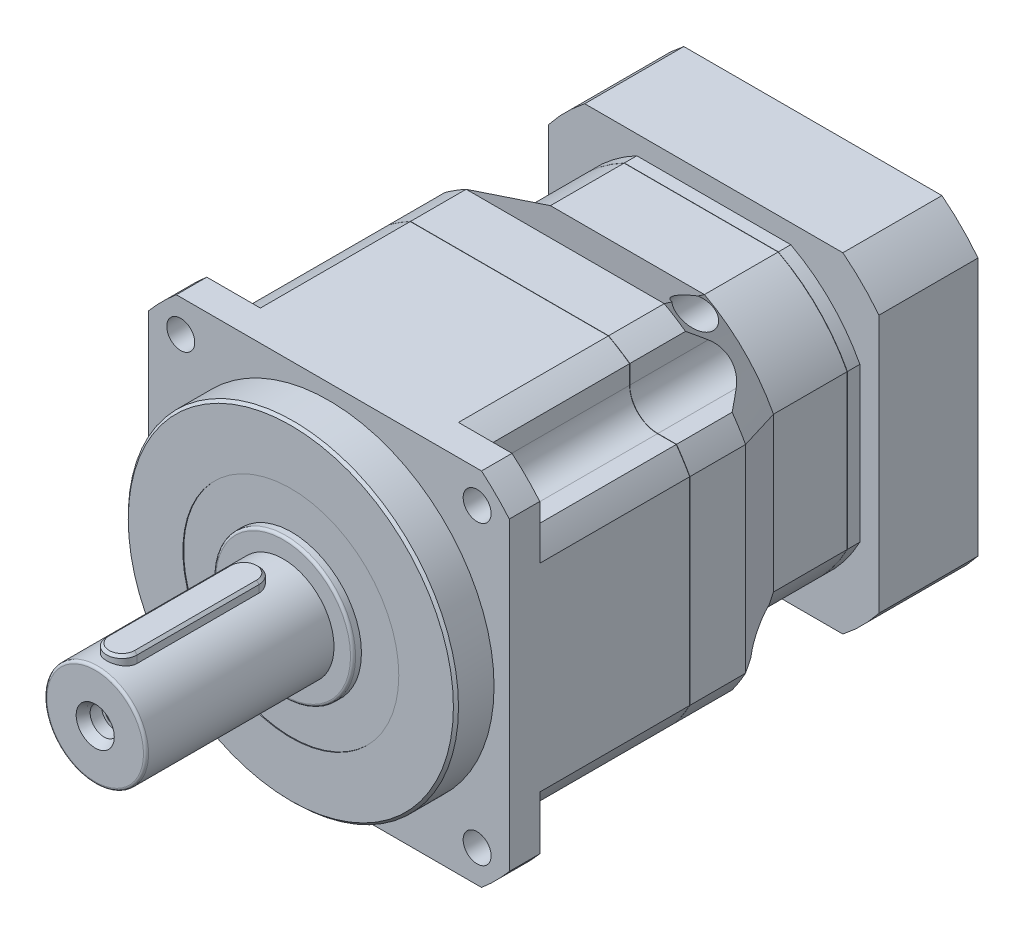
from build123d import *

# Parameters (mm, degrees)
EXTRUDE_1_DEPTH           = 12
SKETCH_2_R                = 65
EXTRUDE_2_DEPTH           = 15
EXTRUDE_3_DEPTH           = 59
SKETCH_4_W                = 30.965241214
SKETCH_4_H                = 26.742708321
CUT_EXTRUDE_1_DEPTH       = 59
PATTERN_CIRCULAR_1_COUNT  = 4
FILLET_1_R                = 11
EXTRUDE_4_DEPTH           = 21.9
EXTRUDE_12_DEPTH          = 29
CUT_EXTRUDE_2_DEPTH       = 50
PATTERN_CIRCULAR_2_COUNT  = 4
EXTRUDE_5_DEPTH           = 4.9
SKETCH_8_W                = 130
SKETCH_8_H                = 130
EXTRUDE_6_DEPTH           = 39
SKETCH_9_OUTSIDE_W        = 201.466
SKETCH_9_OUTSIDE_H        = 201.466
SKETCH_9_OUTSIDE_R        = 82.5
CUT_EXTRUDE_3_DEPTH       = 39
SKETCH_10_R               = 55
CUT_EXTRUDE_4_DEPTH       = 11
SKETCH_26_R               = 54.5
CUT_EXTRUDE_12_DEPTH      = 8.5
SKETCH_27_R               = 7
CUT_EXTRUDE_13_DEPTH      = 32.5
PATTERN_CIRCULAR_7_COUNT  = 6
SKETCH_28_R               = 37
CUT_EXTRUDE_14_DEPTH      = 21
SKETCH_29_R               = 32
EXTRUDE_13_DEPTH          = 20.5
CHAMFER_4_SIZE            = 1.5
SKETCH_30_R               = 12
CUT_EXTRUDE_15_DEPTH      = 65.5
SKETCH_31_W               = 68.763053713
SKETCH_31_H               = 1
CUT_EXTRUDE_16_DEPTH      = 20.5
SKETCH_32_R               = 6
EXTRUDE_14_DEPTH          = 7
PATTERN_CIRCULAR_8_COUNT  = 6
PATTERN_CIRCULAR_9_COUNT  = 4
CHAMFER_2_SIZE            = 1
SKETCH_19_R               = 5.5
CUT_EXTRUDE_10_DEPTH      = 83.5
PATTERN_CIRCULAR_5_COUNT  = 4
SKETCH_20_R               = 27.5
EXTRUDE_8_DEPTH           = 3
FILLET_3_R                = 1
SKETCH_21_R               = 20
EXTRUDE_9_DEPTH           = 74
FILLET_4_R                = 1
CUT_EXTRUDE_START         = -0.3
SKETCH_22_R               = 42.5
SKETCH_22_R_2             = 27.5
CUT_EXTRUDE_11_DEPTH      = 0.3
EXTRUDE_10_DEPTH          = 23
CHAMFER_3_SIZE            = 1
SKETCH_35_R               = 7
CUT_EXTRUDE_17_DEPTH      = 60
PATTERN_CIRCULAR_10_COUNT = 4
SKETCH_36_R               = 5.5
CUT_EXTRUDE_18_DEPTH      = 8
SKETCH_37_R               = 7.5
SKETCH_38_R               = 5.5


with BuildPart() as part:
    # Sketch 1 → Extrude 1 (new body)
    with BuildSketch(Plane.XY):
        with BuildLine():
            Line((-60.066629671, 71), (60.066629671, 71))
            ThreePointArc((60.066629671, 71), (65.76093065, 65.76093065), (71, 60.066629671))
            Line((71, 60.066629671), (71, -60.066629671))
            ThreePointArc((71, -60.066629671), (65.76093065, -65.76093065), (60.066629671, -71))
            Line((60.066629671, -71), (-60.066629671, -71))
            ThreePointArc((-60.066629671, -71), (-65.76093065, -65.76093065), (-71, -60.066629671))
            Line((-71, -60.066629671), (-71, 60.066629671))
            ThreePointArc((-71, 60.066629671), (-65.76093065, 65.76093065), (-60.066629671, 71))
        make_face()
    extrude(amount=EXTRUDE_1_DEPTH)

    # Sketch 2 → Extrude 2 (add)
    with BuildSketch(Plane.XY.offset(12)):
        Circle(SKETCH_2_R)
    extrude(amount=EXTRUDE_2_DEPTH)

    # Sketch 3 → Extrude 3 (add)
    with BuildSketch(Plane(origin=(0, 0, 0), x_dir=(-1, 0, 0), z_dir=(0, 0, -1))):
        with BuildLine():
            Line((-38.987177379, 71), (38.987177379, 71))
            ThreePointArc((38.987177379, 71), (57.275649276, 57.275649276), (71, 38.987177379))
            Line((71, 38.987177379), (71, -38.987177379))
            ThreePointArc((71, -38.987177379), (57.275649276, -57.275649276), (38.987177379, -71))
            Line((38.987177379, -71), (-38.987177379, -71))
            ThreePointArc((-38.987177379, -71), (-57.275649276, -57.275649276), (-71, -38.987177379))
            Line((-71, -38.987177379), (-71, 38.987177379))
            ThreePointArc((-71, 38.987177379), (-57.275649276, 57.275649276), (-38.987177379, 71))
        make_face()
    extrude(amount=EXTRUDE_3_DEPTH)

    # Sketch 4 → Cut-Extrude 1 (cut)
    with BuildSketch(Plane(origin=(0, 0, -59), x_dir=(-1, 0, 0), z_dir=(0, 0, -1))):
        with Locations((-62.832620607, 60.72135416)):
            Rectangle(SKETCH_4_W, SKETCH_4_H)
    cut_extrude_1 = extrude(amount=-CUT_EXTRUDE_1_DEPTH, mode=Mode.SUBTRACT)

    # Pattern Circular 1: Cut-Extrude 1 ×4 about axis
    pattern_circular_1_axis = Axis((0, 0, 0), (0, 0, 1))
    for i in range(1, PATTERN_CIRCULAR_1_COUNT):
        add(cut_extrude_1.rotate(pattern_circular_1_axis, i * 360 / PATTERN_CIRCULAR_1_COUNT), mode=Mode.SUBTRACT)

    # Fillet 1
    fillet_1_edges = [part.edges().sort_by_distance(p)[0] for p in [
        (-47.35, -47.35, -29.5),
        (47.35, -47.35, -29.5),
        (47.35, 47.35, -29.5),
        (-47.35, 47.35, -29.5),
    ]]
    fillet(fillet_1_edges, radius=FILLET_1_R)

    # Chamfer 2
    chamfer_2_edges = [part.edges().sort_by_distance(p)[0] for p in [
        (-65, 0, 27),
    ]]
    chamfer(chamfer_2_edges, length=CHAMFER_2_SIZE)

    # Sketch 19 → Cut-Extrude 10 (cut)
    with BuildSketch(Plane.XY.offset(12)):
        with Locations((-58.336309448, 58.336309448)):
            Circle(SKETCH_19_R)
    cut_extrude_10 = extrude(amount=-CUT_EXTRUDE_10_DEPTH, mode=Mode.SUBTRACT)

    # Pattern Circular 5: Cut-Extrude 10 ×4 about axis
    pattern_circular_5_axis = Axis((0, 0, 0), (0, 0, 1))
    for i in range(1, PATTERN_CIRCULAR_5_COUNT):
        add(cut_extrude_10.rotate(pattern_circular_5_axis, i * 360 / PATTERN_CIRCULAR_5_COUNT), mode=Mode.SUBTRACT)

    # Sketch 20 → Extrude 8 (add)
    with BuildSketch(Plane.XY.offset(27)):
        Circle(SKETCH_20_R)
    extrude(amount=EXTRUDE_8_DEPTH)

    # Fillet 3
    fillet_3_edges = [part.edges().sort_by_distance(p)[0] for p in [
        (-27.5, 0, 30),
    ]]
    fillet(fillet_3_edges, radius=FILLET_3_R)

    # Sketch 21 → Extrude 9 (add)
    with BuildSketch(Plane.XY.offset(30)):
        Circle(SKETCH_21_R)
    extrude(amount=EXTRUDE_9_DEPTH)

    # Fillet 4
    fillet_4_edges = [part.edges().sort_by_distance(p)[0] for p in [
        (-20, 0, 104),
    ]]
    fillet(fillet_4_edges, radius=FILLET_4_R)

    # Sketch 22 → Cut-Extrude 11 (cut)
    with BuildSketch(Plane.XY.offset(27).offset(CUT_EXTRUDE_START)):
        Circle(SKETCH_22_R)
        Circle(SKETCH_22_R_2, mode=Mode.SUBTRACT)
    extrude(amount=CUT_EXTRUDE_11_DEPTH, mode=Mode.SUBTRACT)

    # Sketch 23 → Extrude 10 (add)
    with BuildSketch(Plane(origin=(0, 0, 0), x_dir=(1, 0, 0), z_dir=(0, 1, 0))):
        with BuildLine():
            Line((-6, -93.5), (-6, -45.5))
            ThreePointArc((-6, -45.5), (0, -39.5), (6, -45.5))
            Line((6, -45.5), (6, -93.5))
            ThreePointArc((6, -93.5), (0, -99.5), (-6, -93.5))
        make_face()
    extrude(amount=EXTRUDE_10_DEPTH)

    # Chamfer 3
    chamfer_3_edges = [part.edges().sort_by_distance(p)[0] for p in [
        (0, 23, 99.5),
        (6, 23, 69.5),
        (0, 23, 39.5),
        (-6, 23, 69.5),
    ]]
    chamfer(chamfer_3_edges, length=CHAMFER_3_SIZE)

    # Sketch 36 → Cut-Extrude 18 (cut)
    with BuildSketch(Plane.XY.offset(104)):
        Circle(SKETCH_36_R)
    extrude(amount=-CUT_EXTRUDE_18_DEPTH, mode=Mode.SUBTRACT)

    # Sketch 37 → Loft 1 2 section 0
    with BuildSketch(Plane.XY.offset(104)):
        Circle(SKETCH_37_R)
    # Sketch 38 → Loft 1 2 section 1
    with BuildSketch(Plane.XY.offset(100.5)):
        Circle(SKETCH_38_R)
    loft(mode=Mode.SUBTRACT)

    # Sketch 39 → Hole Wizard M10 _1 (revolve, cut)
    with BuildSketch(Plane(origin=(0, 0, 96), x_dir=(0, -1, 0), z_dir=(1, 0, 0))):
        Polygon((0, 0), (0, 29.553657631), (4.25, 27), (4.25, 0), align=None)
    revolve(axis=Axis((0, 0, 102.35), (0, 0, -1)), mode=Mode.SUBTRACT)


with BuildPart() as body_2:
    # Sketch 5 → Extrude 4 (new body)
    with BuildSketch(Plane(origin=(0, 0, -59.1), x_dir=(-1, 0, 0), z_dir=(0, 0, -1))):
        with BuildLine():
            Line((38.987177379, 71), (-38.987177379, 71))
            ThreePointArc((-38.987177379, 71), (-57.275649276, 57.275649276), (-71, 38.987177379))
            Line((-71, 38.987177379), (-71, -38.987177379))
            ThreePointArc((-71, -38.987177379), (-57.275649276, -57.275649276), (-38.987177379, -71))
            Line((-38.987177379, -71), (38.987177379, -71))
            ThreePointArc((38.987177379, -71), (57.275649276, -57.275649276), (71, -38.987177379))
            Line((71, -38.987177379), (71, 38.987177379))
            ThreePointArc((71, 38.987177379), (57.275649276, 57.275649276), (38.987177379, 71))
        make_face()
    extrude(amount=EXTRUDE_4_DEPTH)



with BuildPart() as body_3:
    # Sketch 25 → Extrude 12 (new body)
    with BuildSketch(Plane(origin=(0, 0, -105.5), x_dir=(-1, 0, 0), z_dir=(0, 0, -1))):
        with BuildLine():
            Line((-30.310889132, 57.5), (30.310889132, 57.5))
            ThreePointArc((30.310889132, 57.5), (45.961940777, 45.961940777), (57.5, 30.310889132))
            Line((57.5, 30.310889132), (57.5, -30.310889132))
            ThreePointArc((57.5, -30.310889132), (45.961940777, -45.961940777), (30.310889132, -57.5))
            Line((30.310889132, -57.5), (-30.310889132, -57.5))
            ThreePointArc((-30.310889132, -57.5), (-45.961940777, -45.961940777), (-57.5, -30.310889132))
            Line((-57.5, -30.310889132), (-57.5, 30.310889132))
            ThreePointArc((-57.5, 30.310889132), (-45.961940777, 45.961940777), (-30.310889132, 57.5))
        make_face()
    extrude(amount=EXTRUDE_12_DEPTH)


with BuildPart() as body_2_1:
    add(body_2.part)

    add(body_3.part)  # loft_1 joins it to this body
    # loft from a face of the part (loft_1)
    loft([body_2_1.faces().sort_by_distance((0, 0, -81))[0], body_2_1.faces().sort_by_distance((0, 0, -105.5))[0]])

    # Sketch 6 → Cut-Extrude 2 (cut)
    with BuildSketch(Plane.XY.offset(-59.1)):
        with BuildLine():
            Line((58.35, -47.35), (65.718928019, -47.35))
            ThreePointArc((65.718928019, -47.35), (57.275649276, -57.275649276), (47.35, -65.718928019))
            Line((47.35, -65.718928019), (47.35, -58.35))
            ThreePointArc((47.35, -58.35), (50.571825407, -50.571825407), (58.35, -47.35))
        make_face()
    cut_extrude_2 = extrude(amount=-CUT_EXTRUDE_2_DEPTH, mode=Mode.SUBTRACT)

    # Pattern Circular 2: Cut-Extrude 2 ×4 about axis
    pattern_circular_2_axis = Axis((0, 0, 0), (0, 0, 1))
    for i in range(1, PATTERN_CIRCULAR_2_COUNT):
        add(cut_extrude_2.rotate(pattern_circular_2_axis, i * 360 / PATTERN_CIRCULAR_2_COUNT), mode=Mode.SUBTRACT)


with BuildPart() as body_3_2:
    # Sketch 7 → Extrude 5 (new body)
    with BuildSketch(Plane(origin=(0, 0, -134.6), x_dir=(-1, 0, 0), z_dir=(0, 0, -1))):
        with BuildLine():
            Line((-30.310889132, 57.5), (30.310889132, 57.5))
            ThreePointArc((30.310889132, 57.5), (45.961940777, 45.961940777), (57.5, 30.310889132))
            Line((57.5, 30.310889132), (57.5, -30.310889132))
            ThreePointArc((57.5, -30.310889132), (45.961940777, -45.961940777), (30.310889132, -57.5))
            Line((30.310889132, -57.5), (-30.310889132, -57.5))
            ThreePointArc((-30.310889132, -57.5), (-45.961940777, -45.961940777), (-57.5, -30.310889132))
            Line((-57.5, -30.310889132), (-57.5, 30.310889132))
            ThreePointArc((-57.5, 30.310889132), (-45.961940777, 45.961940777), (-30.310889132, 57.5))
        make_face()
    extrude(amount=EXTRUDE_5_DEPTH)

    # Sketch 8 → Extrude 6 (add)
    with BuildSketch(Plane(origin=(0, 0, -139.5), x_dir=(-1, 0, 0), z_dir=(0, 0, -1))):
        Rectangle(SKETCH_8_W, SKETCH_8_H)
    extrude(amount=EXTRUDE_6_DEPTH)

    # Sketch 9 outside → Cut-Extrude 3 (cut)
    with BuildSketch(Plane(origin=(0, 0, -178.5), x_dir=(-1, 0, 0), z_dir=(0, 0, -1))):
        Rectangle(SKETCH_9_OUTSIDE_W, SKETCH_9_OUTSIDE_H)
        Circle(SKETCH_9_OUTSIDE_R, mode=Mode.SUBTRACT)
    extrude(amount=-CUT_EXTRUDE_3_DEPTH, mode=Mode.SUBTRACT)

    # Sketch 10 → Cut-Extrude 4 (cut)
    with BuildSketch(Plane(origin=(0, 0, -178.5), x_dir=(-1, 0, 0), z_dir=(0, 0, -1))):
        Circle(SKETCH_10_R)
    extrude(amount=-CUT_EXTRUDE_4_DEPTH, mode=Mode.SUBTRACT)

    # Sketch 26 → Cut-Extrude 12 (cut)
    with BuildSketch(Plane(origin=(0, 0, -167.5), x_dir=(-1, 0, 0), z_dir=(0, 0, -1))):
        Circle(SKETCH_26_R)
    extrude(amount=-CUT_EXTRUDE_12_DEPTH, mode=Mode.SUBTRACT)

    # Sketch 27 → Cut-Extrude 13 (cut)
    with BuildSketch(Plane(origin=(0, 0, -178.5), x_dir=(-1, 0, 0), z_dir=(0, 0, -1))):
        with Locations((-25.171165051, -40.282284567)):
            Circle(SKETCH_27_R)
    cut_extrude_13 = extrude(amount=-CUT_EXTRUDE_13_DEPTH, mode=Mode.SUBTRACT)

    # Pattern Circular 7: Cut-Extrude 13 ×6 about axis
    pattern_circular_7_axis = Axis((0, 0, 0), (0, 0, 1))
    for i in range(1, PATTERN_CIRCULAR_7_COUNT):
        add(cut_extrude_13.rotate(pattern_circular_7_axis, i * 360 / PATTERN_CIRCULAR_7_COUNT), mode=Mode.SUBTRACT)

    # Sketch 28 → Cut-Extrude 14 (cut)
    with BuildSketch(Plane(origin=(0, 0, -159), x_dir=(-1, 0, 0), z_dir=(0, 0, -1))):
        Circle(SKETCH_28_R)
    extrude(amount=-CUT_EXTRUDE_14_DEPTH, mode=Mode.SUBTRACT)

    # Sketch 29 → Extrude 13 (add)
    with BuildSketch(Plane(origin=(0, 0, -158.5), x_dir=(-1, 0, 0), z_dir=(0, 0, -1))):
        Circle(SKETCH_29_R)
    extrude(amount=-EXTRUDE_13_DEPTH)

    # Chamfer 4
    chamfer_4_edges = [body_3_2.edges().sort_by_distance(p)[0] for p in [
        (32, 0, -158.5),
    ]]
    chamfer(chamfer_4_edges, length=CHAMFER_4_SIZE)


with BuildPart() as cut_extrude_15_tool:
    # Sketch 30 → Cut-Extrude 15 (new body)
    with BuildSketch(Plane(origin=(0, 0, -178.5), x_dir=(-1, 0, 0), z_dir=(0, 0, -1))):
        Circle(SKETCH_30_R)
    extrude(amount=-CUT_EXTRUDE_15_DEPTH)


with BuildPart() as body_2_2:
    add(body_2_1.part)

    # Cut-Extrude 15: cut by cut_extrude_15_tool
    add(cut_extrude_15_tool.part, mode=Mode.SUBTRACT)

    # Sketch 35 → Cut-Extrude 17 (cut)
    with BuildSketch(Plane(origin=(0, 0, -73), x_dir=(-1, 0, 0), z_dir=(0, 0, -1))):
        with Locations(Location((-38.419146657, 61.483486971, 0), (0, 0, 80.910916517))):
            Circle(SKETCH_35_R)
    cut_extrude_17 = extrude(amount=CUT_EXTRUDE_17_DEPTH, mode=Mode.SUBTRACT)

    # Pattern Circular 10: Cut-Extrude 17 ×4 about axis
    pattern_circular_10_axis = Axis((0, 0, 0), (0, 0, 1))
    for i in range(1, PATTERN_CIRCULAR_10_COUNT):
        add(cut_extrude_17.rotate(pattern_circular_10_axis, i * 360 / PATTERN_CIRCULAR_10_COUNT), mode=Mode.SUBTRACT)


with BuildPart() as body_3_2_1:
    add(body_3_2.part)

    # Cut-Extrude 15: cut by cut_extrude_15_tool
    add(cut_extrude_15_tool.part, mode=Mode.SUBTRACT)

    # Sketch 31 → Cut-Extrude 16 (cut)
    with BuildSketch(Plane(origin=(0, 0, -158.5), x_dir=(-1, 0, 0), z_dir=(0, 0, -1))):
        with Locations((0.564307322, 0)):
            Rectangle(SKETCH_31_W, SKETCH_31_H)
    extrude(amount=-CUT_EXTRUDE_16_DEPTH, mode=Mode.SUBTRACT)

    # Sketch 32 → Extrude 14 (add)
    with BuildSketch(Plane(origin=(0, 0, -146), x_dir=(-1, 0, 0), z_dir=(0, 0, -1))):
        with Locations((-47.471064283, 1.657726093)):
            Circle(SKETCH_32_R)
        Polygon((-45.879129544, 4.734370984), (-49.339549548, 4.574704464), (-50.931484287, 1.498059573), (-49.062999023, -1.418918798), (-45.602579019, -1.259252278), (-44.01064428, 1.817392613), align=None, mode=Mode.SUBTRACT)
    extrude_14 = extrude(amount=EXTRUDE_14_DEPTH)

    # Pattern Circular 8: Extrude 14 ×6 about axis
    pattern_circular_8_axis = Axis((0, 0, 0), (0, 0, 1))
    for i in range(1, PATTERN_CIRCULAR_8_COUNT):
        add(extrude_14.rotate(pattern_circular_8_axis, i * 360 / PATTERN_CIRCULAR_8_COUNT))

    # Sketch 34 → Hole Wizard M8 _1 (revolve, cut)
    with BuildSketch(Plane(origin=(51.265241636, 51.265241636, -178.5), x_dir=(0, 1, 0), z_dir=(1, 0, 0))):
        Polygon((0, 0), (0, 30.042926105), (3.4, 28), (3.4, 0), align=None)
    hole_wizard_m8_1 = revolve(axis=Axis((51.265241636, 51.265241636, -184.85), (0, 0, 1)), mode=Mode.SUBTRACT)

    # Pattern Circular 9: Hole Wizard M8 _1 ×4 about axis
    pattern_circular_9_axis = Axis((0, 0, 0), (0, 0, 1))
    for i in range(1, PATTERN_CIRCULAR_9_COUNT):
        add(hole_wizard_m8_1.rotate(pattern_circular_9_axis, i * 360 / PATTERN_CIRCULAR_9_COUNT), mode=Mode.SUBTRACT)


solid = Compound([part.part, body_2_2.part, body_3_2_1.part])
